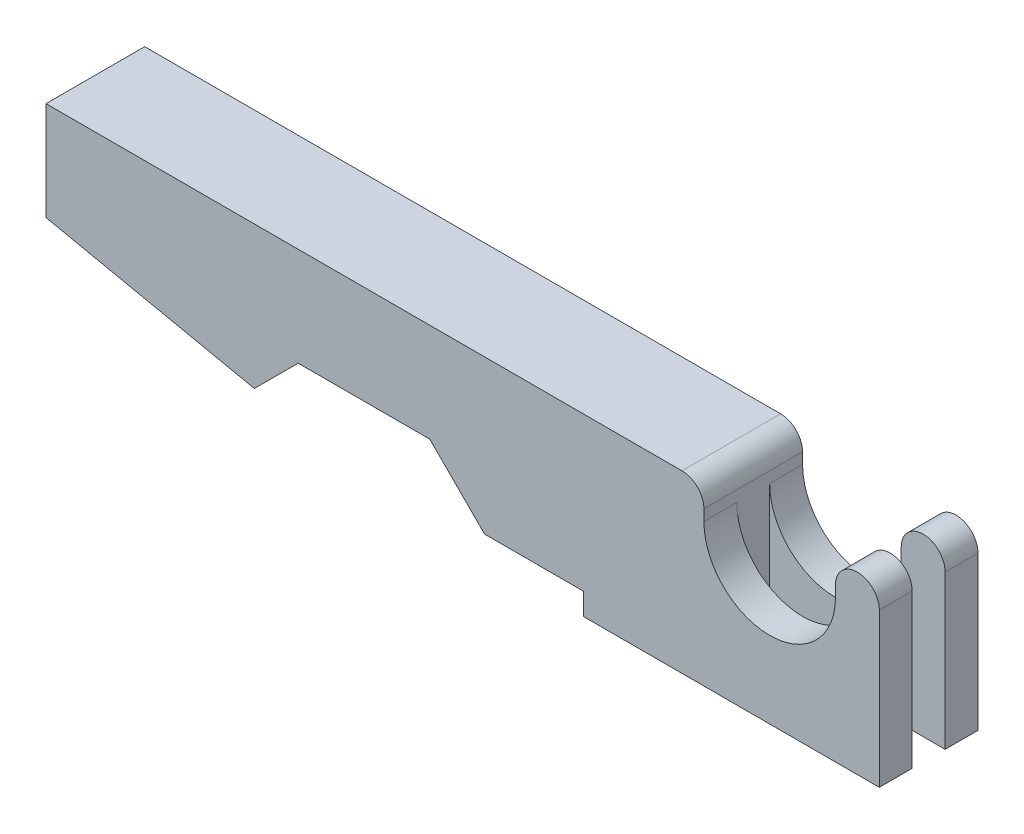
from build123d import *

# Parameters (mm, degrees)
BOSS_EXTRU_1_DEPTH      = 2.25
ESQUISSE2_W             = 8
ESQUISSE2_H             = 1.5
ENL_V_MAT_EXTRU_1_DEPTH = 39.898104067
CONG_1_R                = 1


with BuildPart() as part:
    # Esquisse1 → Boss.-Extru.1 (new, symmetric)
    with BuildSketch(Plane.XY):
        with BuildLine():
            Line((0, 0), (0, 7))
            ThreePointArc((0, 7), (-1, 8), (-2, 7))
            Line((-2, 7), (-2, 6.5))
            ThreePointArc((-2, 6.5), (-5, 3.5), (-8, 6.5))
            Line((-8, 6.5), (-8, 8))
            Line((-8, 8), (-38, 8))
            Line((-38, 8), (-38, 3.5))
            Line((-38, 3.5), (-28.5, 1.5))
            Line((-28.5, 1.5), (-26.5, 3.5))
            Line((-26.5, 3.5), (-20.5, 3.5))
            Line((-20.5, 3.5), (-18, 1))
            Line((-18, 1), (-13.5, 1))
            Line((-13.5, 1), (-13.5, 0))
            Line((-13.5, 0), (0, 0))
        make_face()
    extrude(amount=BOSS_EXTRU_1_DEPTH, both=True)

    # Esquisse2 → Enl_v. mat.-Extru.1 (cut, through all)
    with BuildSketch(Plane.XZ):
        with Locations((-4, 0)):
            Rectangle(ESQUISSE2_W, ESQUISSE2_H)
    extrude(amount=-ENL_V_MAT_EXTRU_1_DEPTH, mode=Mode.SUBTRACT)

    # Cong_1
    cong_1_edges = [part.edges().sort_by_distance(p)[0] for p in [
        (-8, 8, 0),
    ]]
    fillet(cong_1_edges, radius=CONG_1_R)


solid = part.part
